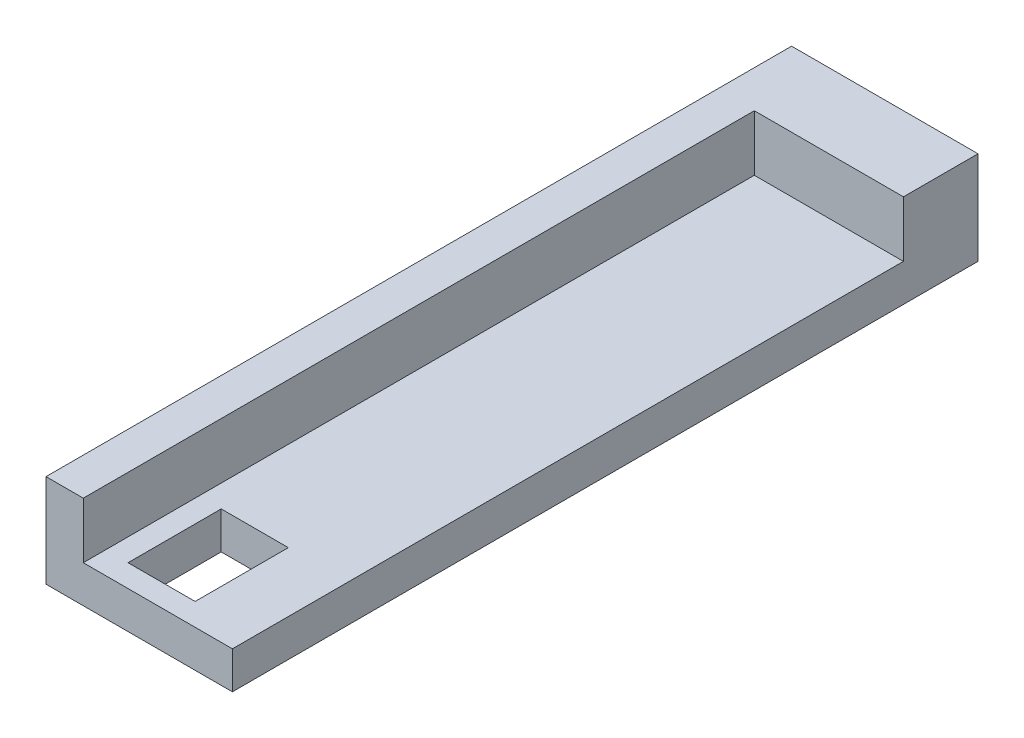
ISO-10303-21;
HEADER;
FILE_DESCRIPTION(('STEP AP214'),'2;1');
FILE_NAME('part.step','',(''),(''),'','','');
FILE_SCHEMA(('AUTOMOTIVE_DESIGN { 1 0 10303 214 1 1 1 1 }'));
ENDSEC;
DATA;
#1=APPLICATION_CONTEXT('core data for automotive mechanical design processes');
#2=APPLICATION_PROTOCOL_DEFINITION('international standard','automotive_design',2000,#1);
#3=PRODUCT_CONTEXT('',#1,'mechanical');
#4=PRODUCT('Part','Part','',(#3));
#5=PRODUCT_RELATED_PRODUCT_CATEGORY('part','',(#4));
#6=PRODUCT_DEFINITION_FORMATION('','',#4);
#7=PRODUCT_DEFINITION_CONTEXT('part definition',#1,'design');
#8=PRODUCT_DEFINITION('design','',#6,#7);
#9=PRODUCT_DEFINITION_SHAPE('','',#8);
#10=(LENGTH_UNIT() NAMED_UNIT(*) SI_UNIT(.MILLI.,.METRE.));
#11=(NAMED_UNIT(*) PLANE_ANGLE_UNIT() SI_UNIT($,.RADIAN.));
#12=(NAMED_UNIT(*) SI_UNIT($,.STERADIAN.) SOLID_ANGLE_UNIT());
#13=UNCERTAINTY_MEASURE_WITH_UNIT(LENGTH_MEASURE(1.E-05),#10,'distance_accuracy_value','');
#14=(GEOMETRIC_REPRESENTATION_CONTEXT(3) GLOBAL_UNCERTAINTY_ASSIGNED_CONTEXT((#13)) GLOBAL_UNIT_ASSIGNED_CONTEXT((#10,
#11,#12)) REPRESENTATION_CONTEXT('',''));
#15=CARTESIAN_POINT('',(0.,0.,0.));
#16=DIRECTION('',(0.,0.,1.));
#17=DIRECTION('',(1.,0.,0.));
#18=AXIS2_PLACEMENT_3D('',#15,#16,#17);
#19=CARTESIAN_POINT('',(50.,0.,200.));
#20=DIRECTION('',(-1.,0.,0.));
#21=DIRECTION('',(0.,0.,1.));
#22=AXIS2_PLACEMENT_3D('',#19,#20,#21);
#23=PLANE('',#22);
#24=DIRECTION('',(0.,1.,0.));
#25=VECTOR('',#24,1.);
#26=CARTESIAN_POINT('',(50.,0.,20.));
#27=LINE('',#26,#25);
#28=CARTESIAN_POINT('',(50.,10.,20.));
#29=VERTEX_POINT('',#28);
#30=CARTESIAN_POINT('',(50.,25.,20.));
#31=VERTEX_POINT('',#30);
#32=EDGE_CURVE('E161',#29,#31,#27,.T.);
#33=ORIENTED_EDGE('',*,*,#32,.F.);
#34=DIRECTION('',(0.,0.,-1.));
#35=VECTOR('',#34,1.);
#36=CARTESIAN_POINT('',(50.,10.,200.));
#37=LINE('',#36,#35);
#38=CARTESIAN_POINT('',(50.,10.,200.));
#39=VERTEX_POINT('',#38);
#40=EDGE_CURVE('E159',#39,#29,#37,.T.);
#41=ORIENTED_EDGE('',*,*,#40,.F.);
#42=DIRECTION('',(0.,1.,0.));
#43=VECTOR('',#42,1.);
#44=CARTESIAN_POINT('',(50.,0.,200.));
#45=LINE('',#44,#43);
#46=CARTESIAN_POINT('',(50.,0.,200.));
#47=VERTEX_POINT('',#46);
#48=EDGE_CURVE('E181',#47,#39,#45,.T.);
#49=ORIENTED_EDGE('',*,*,#48,.F.);
#50=DIRECTION('',(0.,0.,-1.));
#51=VECTOR('',#50,1.);
#52=CARTESIAN_POINT('',(50.,0.,200.));
#53=LINE('',#52,#51);
#54=CARTESIAN_POINT('',(50.,0.,0.));
#55=VERTEX_POINT('',#54);
#56=EDGE_CURVE('E40',#47,#55,#53,.T.);
#57=ORIENTED_EDGE('',*,*,#56,.T.);
#58=DIRECTION('',(0.,1.,0.));
#59=VECTOR('',#58,1.);
#60=CARTESIAN_POINT('',(50.,0.,0.));
#61=LINE('',#60,#59);
#62=CARTESIAN_POINT('',(50.,25.,0.));
#63=VERTEX_POINT('',#62);
#64=EDGE_CURVE('E191',#55,#63,#61,.T.);
#65=ORIENTED_EDGE('',*,*,#64,.T.);
#66=DIRECTION('',(0.,0.,-1.));
#67=VECTOR('',#66,1.);
#68=CARTESIAN_POINT('',(50.,25.,200.));
#69=LINE('',#68,#67);
#70=EDGE_CURVE('E197',#31,#63,#69,.T.);
#71=ORIENTED_EDGE('',*,*,#70,.F.);
#72=EDGE_LOOP('',(#33,#41,#49,#57,#65,#71));
#73=FACE_BOUND('',#72,.T.);
#74=ADVANCED_FACE('F32',(#73),#23,.F.);
#75=CARTESIAN_POINT('',(0.,25.,200.));
#76=DIRECTION('',(0.,-1.,0.));
#77=DIRECTION('',(0.,0.,-1.));
#78=AXIS2_PLACEMENT_3D('',#75,#76,#77);
#79=PLANE('',#78);
#80=DIRECTION('',(-1.,0.,0.));
#81=VECTOR('',#80,1.);
#82=CARTESIAN_POINT('',(0.,25.,20.));
#83=LINE('',#82,#81);
#84=CARTESIAN_POINT('',(10.,25.,20.));
#85=VERTEX_POINT('',#84);
#86=EDGE_CURVE('E166',#31,#85,#83,.T.);
#87=ORIENTED_EDGE('',*,*,#86,.F.);
#88=ORIENTED_EDGE('',*,*,#70,.T.);
#89=DIRECTION('',(-1.,0.,0.));
#90=VECTOR('',#89,1.);
#91=CARTESIAN_POINT('',(0.,25.,0.));
#92=LINE('',#91,#90);
#93=CARTESIAN_POINT('',(0.,25.,0.));
#94=VERTEX_POINT('',#93);
#95=EDGE_CURVE('E179',#63,#94,#92,.T.);
#96=ORIENTED_EDGE('',*,*,#95,.T.);
#97=DIRECTION('',(0.,0.,-1.));
#98=VECTOR('',#97,1.);
#99=CARTESIAN_POINT('',(0.,25.,200.));
#100=LINE('',#99,#98);
#101=CARTESIAN_POINT('',(0.,25.,200.));
#102=VERTEX_POINT('',#101);
#103=EDGE_CURVE('E186',#102,#94,#100,.T.);
#104=ORIENTED_EDGE('',*,*,#103,.F.);
#105=DIRECTION('',(-1.,0.,0.));
#106=VECTOR('',#105,1.);
#107=CARTESIAN_POINT('',(0.,25.,200.));
#108=LINE('',#107,#106);
#109=CARTESIAN_POINT('',(10.,25.,200.));
#110=VERTEX_POINT('',#109);
#111=EDGE_CURVE('E184',#110,#102,#108,.T.);
#112=ORIENTED_EDGE('',*,*,#111,.F.);
#113=DIRECTION('',(0.,0.,-1.));
#114=VECTOR('',#113,1.);
#115=CARTESIAN_POINT('',(10.,25.,200.));
#116=LINE('',#115,#114);
#117=EDGE_CURVE('E168',#110,#85,#116,.T.);
#118=ORIENTED_EDGE('',*,*,#117,.T.);
#119=EDGE_LOOP('',(#87,#88,#96,#104,#112,#118));
#120=FACE_BOUND('',#119,.T.);
#121=ADVANCED_FACE('F213',(#120),#79,.F.);
#122=CARTESIAN_POINT('',(0.,0.,200.));
#123=DIRECTION('',(0.,0.,-1.));
#124=DIRECTION('',(-1.,0.,0.));
#125=AXIS2_PLACEMENT_3D('',#122,#123,#124);
#126=PLANE('',#125);
#127=DIRECTION('',(0.,-1.,0.));
#128=VECTOR('',#127,1.);
#129=CARTESIAN_POINT('',(10.,0.,200.));
#130=LINE('',#129,#128);
#131=CARTESIAN_POINT('',(10.,10.,200.));
#132=VERTEX_POINT('',#131);
#133=EDGE_CURVE('E162',#110,#132,#130,.T.);
#134=ORIENTED_EDGE('',*,*,#133,.F.);
#135=ORIENTED_EDGE('',*,*,#111,.T.);
#136=DIRECTION('',(0.,-1.,0.));
#137=VECTOR('',#136,1.);
#138=CARTESIAN_POINT('',(0.,0.,200.));
#139=LINE('',#138,#137);
#140=CARTESIAN_POINT('',(0.,0.,200.));
#141=VERTEX_POINT('',#140);
#142=EDGE_CURVE('E175',#102,#141,#139,.T.);
#143=ORIENTED_EDGE('',*,*,#142,.T.);
#144=DIRECTION('',(1.,0.,0.));
#145=VECTOR('',#144,1.);
#146=CARTESIAN_POINT('',(0.,0.,200.));
#147=LINE('',#146,#145);
#148=EDGE_CURVE('E178',#141,#47,#147,.T.);
#149=ORIENTED_EDGE('',*,*,#148,.T.);
#150=ORIENTED_EDGE('',*,*,#48,.T.);
#151=DIRECTION('',(1.,0.,0.));
#152=VECTOR('',#151,1.);
#153=CARTESIAN_POINT('',(0.,10.,200.));
#154=LINE('',#153,#152);
#155=EDGE_CURVE('E165',#132,#39,#154,.T.);
#156=ORIENTED_EDGE('',*,*,#155,.F.);
#157=EDGE_LOOP('',(#134,#135,#143,#149,#150,#156));
#158=FACE_BOUND('',#157,.T.);
#159=ADVANCED_FACE('F220',(#158),#126,.F.);
#160=CARTESIAN_POINT('',(0.,0.,200.));
#161=DIRECTION('',(1.,0.,0.));
#162=DIRECTION('',(0.,0.,-1.));
#163=AXIS2_PLACEMENT_3D('',#160,#161,#162);
#164=PLANE('',#163);
#165=DIRECTION('',(0.,-1.,0.));
#166=VECTOR('',#165,1.);
#167=CARTESIAN_POINT('',(0.,0.,0.));
#168=LINE('',#167,#166);
#169=CARTESIAN_POINT('',(0.,0.,0.));
#170=VERTEX_POINT('',#169);
#171=EDGE_CURVE('E158',#94,#170,#168,.T.);
#172=ORIENTED_EDGE('',*,*,#171,.T.);
#173=DIRECTION('',(0.,0.,-1.));
#174=VECTOR('',#173,1.);
#175=CARTESIAN_POINT('',(0.,0.,200.));
#176=LINE('',#175,#174);
#177=EDGE_CURVE('E11',#141,#170,#176,.T.);
#178=ORIENTED_EDGE('',*,*,#177,.F.);
#179=ORIENTED_EDGE('',*,*,#142,.F.);
#180=ORIENTED_EDGE('',*,*,#103,.T.);
#181=EDGE_LOOP('',(#172,#178,#179,#180));
#182=FACE_BOUND('',#181,.T.);
#183=ADVANCED_FACE('F34',(#182),#164,.F.);
#184=CARTESIAN_POINT('',(0.,0.,200.));
#185=DIRECTION('',(0.,1.,0.));
#186=DIRECTION('',(0.,0.,1.));
#187=AXIS2_PLACEMENT_3D('',#184,#185,#186);
#188=PLANE('',#187);
#189=DIRECTION('',(-1.,0.,0.));
#190=VECTOR('',#189,1.);
#191=CARTESIAN_POINT('',(16.,0.,169.));
#192=LINE('',#191,#190);
#193=CARTESIAN_POINT('',(34.,0.,169.));
#194=VERTEX_POINT('',#193);
#195=CARTESIAN_POINT('',(16.,0.,169.));
#196=VERTEX_POINT('',#195);
#197=EDGE_CURVE('E123',#194,#196,#192,.T.);
#198=ORIENTED_EDGE('',*,*,#197,.T.);
#199=DIRECTION('',(0.,0.,1.));
#200=VECTOR('',#199,1.);
#201=CARTESIAN_POINT('',(16.,0.,194.));
#202=LINE('',#201,#200);
#203=CARTESIAN_POINT('',(16.,0.,194.));
#204=VERTEX_POINT('',#203);
#205=EDGE_CURVE('E117',#196,#204,#202,.T.);
#206=ORIENTED_EDGE('',*,*,#205,.T.);
#207=DIRECTION('',(1.,0.,0.));
#208=VECTOR('',#207,1.);
#209=CARTESIAN_POINT('',(16.,0.,194.));
#210=LINE('',#209,#208);
#211=CARTESIAN_POINT('',(34.,0.,194.));
#212=VERTEX_POINT('',#211);
#213=EDGE_CURVE('E126',#204,#212,#210,.T.);
#214=ORIENTED_EDGE('',*,*,#213,.T.);
#215=DIRECTION('',(0.,0.,-1.));
#216=VECTOR('',#215,1.);
#217=CARTESIAN_POINT('',(34.,0.,194.));
#218=LINE('',#217,#216);
#219=EDGE_CURVE('E47',#212,#194,#218,.T.);
#220=ORIENTED_EDGE('',*,*,#219,.T.);
#221=EDGE_LOOP('',(#198,#206,#214,#220));
#222=FACE_BOUND('',#221,.T.);
#223=DIRECTION('',(1.,0.,0.));
#224=VECTOR('',#223,1.);
#225=CARTESIAN_POINT('',(0.,0.,0.));
#226=LINE('',#225,#224);
#227=EDGE_CURVE('E189',#170,#55,#226,.T.);
#228=ORIENTED_EDGE('',*,*,#227,.T.);
#229=ORIENTED_EDGE('',*,*,#56,.F.);
#230=ORIENTED_EDGE('',*,*,#148,.F.);
#231=ORIENTED_EDGE('',*,*,#177,.T.);
#232=EDGE_LOOP('',(#228,#229,#230,#231));
#233=FACE_BOUND('',#232,.T.);
#234=ADVANCED_FACE('F130',(#222,#233),#188,.F.);
#235=CARTESIAN_POINT('',(0.,0.,0.));
#236=DIRECTION('',(0.,0.,-1.));
#237=DIRECTION('',(-1.,0.,0.));
#238=AXIS2_PLACEMENT_3D('',#235,#236,#237);
#239=PLANE('',#238);
#240=ORIENTED_EDGE('',*,*,#171,.F.);
#241=ORIENTED_EDGE('',*,*,#95,.F.);
#242=ORIENTED_EDGE('',*,*,#64,.F.);
#243=ORIENTED_EDGE('',*,*,#227,.F.);
#244=EDGE_LOOP('',(#240,#241,#242,#243));
#245=FACE_BOUND('',#244,.T.);
#246=ADVANCED_FACE('F209',(#245),#239,.T.);
#247=CARTESIAN_POINT('',(10.,0.,200.));
#248=DIRECTION('',(1.,0.,0.));
#249=DIRECTION('',(0.,0.,-1.));
#250=AXIS2_PLACEMENT_3D('',#247,#248,#249);
#251=PLANE('',#250);
#252=DIRECTION('',(0.,-1.,0.));
#253=VECTOR('',#252,1.);
#254=CARTESIAN_POINT('',(10.,0.,20.));
#255=LINE('',#254,#253);
#256=CARTESIAN_POINT('',(10.,10.,20.));
#257=VERTEX_POINT('',#256);
#258=EDGE_CURVE('E148',#85,#257,#255,.T.);
#259=ORIENTED_EDGE('',*,*,#258,.F.);
#260=ORIENTED_EDGE('',*,*,#117,.F.);
#261=ORIENTED_EDGE('',*,*,#133,.T.);
#262=DIRECTION('',(0.,0.,-1.));
#263=VECTOR('',#262,1.);
#264=CARTESIAN_POINT('',(10.,10.,200.));
#265=LINE('',#264,#263);
#266=EDGE_CURVE('E155',#132,#257,#265,.T.);
#267=ORIENTED_EDGE('',*,*,#266,.T.);
#268=EDGE_LOOP('',(#259,#260,#261,#267));
#269=FACE_BOUND('',#268,.T.);
#270=ADVANCED_FACE('F224',(#269),#251,.T.);
#271=CARTESIAN_POINT('',(0.,10.,200.));
#272=DIRECTION('',(0.,1.,0.));
#273=DIRECTION('',(0.,0.,1.));
#274=AXIS2_PLACEMENT_3D('',#271,#272,#273);
#275=PLANE('',#274);
#276=DIRECTION('',(0.,0.,1.));
#277=VECTOR('',#276,1.);
#278=CARTESIAN_POINT('',(16.,10.,194.));
#279=LINE('',#278,#277);
#280=CARTESIAN_POINT('',(16.,10.,169.));
#281=VERTEX_POINT('',#280);
#282=CARTESIAN_POINT('',(16.,10.,194.));
#283=VERTEX_POINT('',#282);
#284=EDGE_CURVE('E55',#281,#283,#279,.T.);
#285=ORIENTED_EDGE('',*,*,#284,.F.);
#286=DIRECTION('',(-1.,0.,0.));
#287=VECTOR('',#286,1.);
#288=CARTESIAN_POINT('',(16.,10.,169.));
#289=LINE('',#288,#287);
#290=CARTESIAN_POINT('',(34.,10.,169.));
#291=VERTEX_POINT('',#290);
#292=EDGE_CURVE('E133',#291,#281,#289,.T.);
#293=ORIENTED_EDGE('',*,*,#292,.F.);
#294=DIRECTION('',(0.,0.,-1.));
#295=VECTOR('',#294,1.);
#296=CARTESIAN_POINT('',(34.,10.,194.));
#297=LINE('',#296,#295);
#298=CARTESIAN_POINT('',(34.,10.,194.));
#299=VERTEX_POINT('',#298);
#300=EDGE_CURVE('E136',#299,#291,#297,.T.);
#301=ORIENTED_EDGE('',*,*,#300,.F.);
#302=DIRECTION('',(1.,0.,0.));
#303=VECTOR('',#302,1.);
#304=CARTESIAN_POINT('',(16.,10.,194.));
#305=LINE('',#304,#303);
#306=EDGE_CURVE('E142',#283,#299,#305,.T.);
#307=ORIENTED_EDGE('',*,*,#306,.F.);
#308=EDGE_LOOP('',(#285,#293,#301,#307));
#309=FACE_BOUND('',#308,.T.);
#310=DIRECTION('',(1.,0.,0.));
#311=VECTOR('',#310,1.);
#312=CARTESIAN_POINT('',(0.,10.,20.));
#313=LINE('',#312,#311);
#314=EDGE_CURVE('E154',#257,#29,#313,.T.);
#315=ORIENTED_EDGE('',*,*,#314,.F.);
#316=ORIENTED_EDGE('',*,*,#266,.F.);
#317=ORIENTED_EDGE('',*,*,#155,.T.);
#318=ORIENTED_EDGE('',*,*,#40,.T.);
#319=EDGE_LOOP('',(#315,#316,#317,#318));
#320=FACE_BOUND('',#319,.T.);
#321=ADVANCED_FACE('F228',(#309,#320),#275,.T.);
#322=CARTESIAN_POINT('',(0.,0.,20.));
#323=DIRECTION('',(0.,0.,-1.));
#324=DIRECTION('',(-1.,0.,0.));
#325=AXIS2_PLACEMENT_3D('',#322,#323,#324);
#326=PLANE('',#325);
#327=ORIENTED_EDGE('',*,*,#258,.T.);
#328=ORIENTED_EDGE('',*,*,#314,.T.);
#329=ORIENTED_EDGE('',*,*,#32,.T.);
#330=ORIENTED_EDGE('',*,*,#86,.T.);
#331=EDGE_LOOP('',(#327,#328,#329,#330));
#332=FACE_BOUND('',#331,.T.);
#333=ADVANCED_FACE('F226',(#332),#326,.F.);
#334=CARTESIAN_POINT('',(16.,0.,194.));
#335=DIRECTION('',(-1.,0.,0.));
#336=DIRECTION('',(0.,0.,1.));
#337=AXIS2_PLACEMENT_3D('',#334,#335,#336);
#338=PLANE('',#337);
#339=ORIENTED_EDGE('',*,*,#284,.T.);
#340=DIRECTION('',(0.,1.,0.));
#341=VECTOR('',#340,1.);
#342=CARTESIAN_POINT('',(16.,0.,194.));
#343=LINE('',#342,#341);
#344=EDGE_CURVE('E113',#204,#283,#343,.T.);
#345=ORIENTED_EDGE('',*,*,#344,.F.);
#346=ORIENTED_EDGE('',*,*,#205,.F.);
#347=DIRECTION('',(0.,1.,0.));
#348=VECTOR('',#347,1.);
#349=CARTESIAN_POINT('',(16.,0.,169.));
#350=LINE('',#349,#348);
#351=EDGE_CURVE('E146',#196,#281,#350,.T.);
#352=ORIENTED_EDGE('',*,*,#351,.T.);
#353=EDGE_LOOP('',(#339,#345,#346,#352));
#354=FACE_BOUND('',#353,.T.);
#355=ADVANCED_FACE('F115',(#354),#338,.F.);
#356=CARTESIAN_POINT('',(16.,0.,169.));
#357=DIRECTION('',(0.,0.,-1.));
#358=DIRECTION('',(-1.,0.,0.));
#359=AXIS2_PLACEMENT_3D('',#356,#357,#358);
#360=PLANE('',#359);
#361=ORIENTED_EDGE('',*,*,#292,.T.);
#362=ORIENTED_EDGE('',*,*,#351,.F.);
#363=ORIENTED_EDGE('',*,*,#197,.F.);
#364=DIRECTION('',(0.,1.,0.));
#365=VECTOR('',#364,1.);
#366=CARTESIAN_POINT('',(34.,0.,169.));
#367=LINE('',#366,#365);
#368=EDGE_CURVE('E149',#194,#291,#367,.T.);
#369=ORIENTED_EDGE('',*,*,#368,.T.);
#370=EDGE_LOOP('',(#361,#362,#363,#369));
#371=FACE_BOUND('',#370,.T.);
#372=ADVANCED_FACE('F296',(#371),#360,.F.);
#373=CARTESIAN_POINT('',(34.,0.,194.));
#374=DIRECTION('',(1.,0.,0.));
#375=DIRECTION('',(0.,0.,-1.));
#376=AXIS2_PLACEMENT_3D('',#373,#374,#375);
#377=PLANE('',#376);
#378=ORIENTED_EDGE('',*,*,#300,.T.);
#379=ORIENTED_EDGE('',*,*,#368,.F.);
#380=ORIENTED_EDGE('',*,*,#219,.F.);
#381=DIRECTION('',(0.,1.,0.));
#382=VECTOR('',#381,1.);
#383=CARTESIAN_POINT('',(34.,0.,194.));
#384=LINE('',#383,#382);
#385=EDGE_CURVE('E122',#212,#299,#384,.T.);
#386=ORIENTED_EDGE('',*,*,#385,.T.);
#387=EDGE_LOOP('',(#378,#379,#380,#386));
#388=FACE_BOUND('',#387,.T.);
#389=ADVANCED_FACE('F305',(#388),#377,.F.);
#390=CARTESIAN_POINT('',(16.,0.,194.));
#391=DIRECTION('',(0.,0.,1.));
#392=DIRECTION('',(1.,0.,0.));
#393=AXIS2_PLACEMENT_3D('',#390,#391,#392);
#394=PLANE('',#393);
#395=ORIENTED_EDGE('',*,*,#306,.T.);
#396=ORIENTED_EDGE('',*,*,#385,.F.);
#397=ORIENTED_EDGE('',*,*,#213,.F.);
#398=ORIENTED_EDGE('',*,*,#344,.T.);
#399=EDGE_LOOP('',(#395,#396,#397,#398));
#400=FACE_BOUND('',#399,.T.);
#401=ADVANCED_FACE('F127',(#400),#394,.F.);
#402=CLOSED_SHELL('',(#74,#121,#159,#183,#234,#246,#270,#321,#333,#355,#372,#389,#401));
#403=MANIFOLD_SOLID_BREP('B2',#402);
#404=ADVANCED_BREP_SHAPE_REPRESENTATION('',(#18,#403),#14);
#405=SHAPE_DEFINITION_REPRESENTATION(#9,#404);
ENDSEC;
END-ISO-10303-21;
